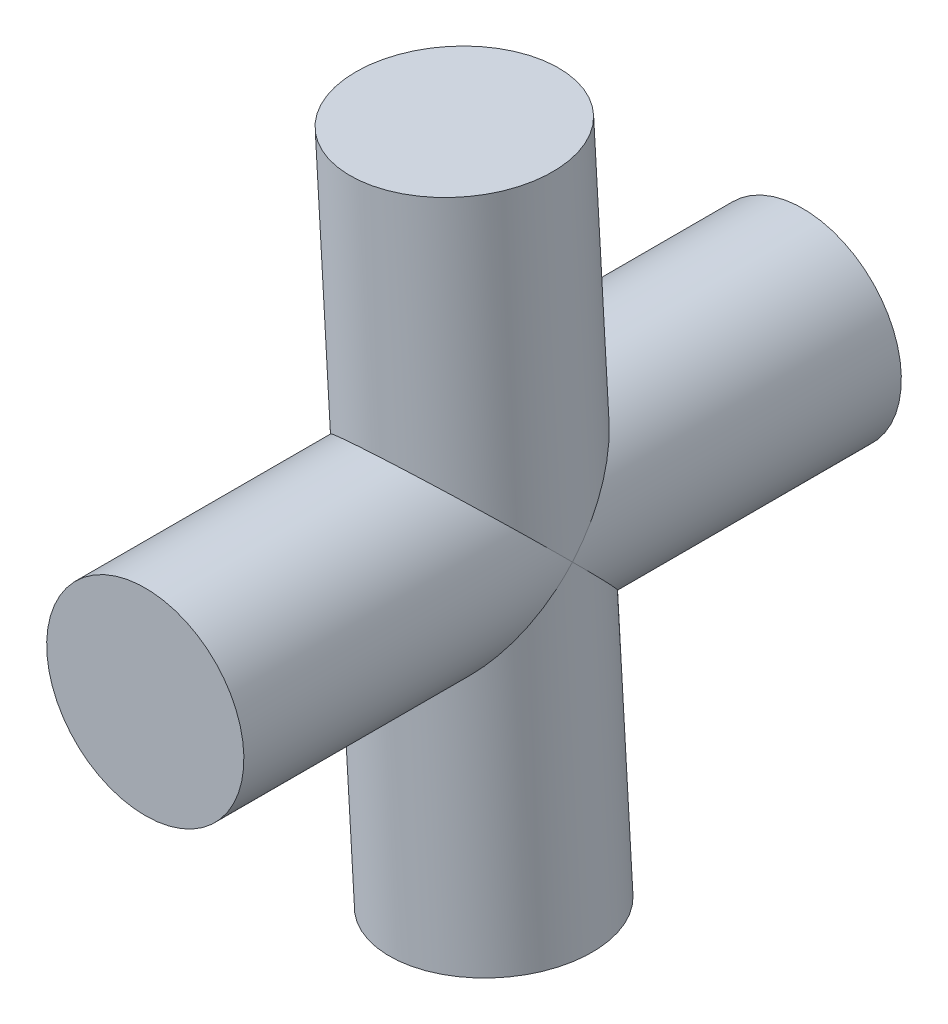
ISO-10303-21;
HEADER;
FILE_DESCRIPTION(('STEP AP214'),'2;1');
FILE_NAME('part.step','',(''),(''),'','','');
FILE_SCHEMA(('AUTOMOTIVE_DESIGN { 1 0 10303 214 1 1 1 1 }'));
ENDSEC;
DATA;
#1=APPLICATION_CONTEXT('core data for automotive mechanical design processes');
#2=APPLICATION_PROTOCOL_DEFINITION('international standard','automotive_design',2000,#1);
#3=PRODUCT_CONTEXT('',#1,'mechanical');
#4=PRODUCT('Part','Part','',(#3));
#5=PRODUCT_RELATED_PRODUCT_CATEGORY('part','',(#4));
#6=PRODUCT_DEFINITION_FORMATION('','',#4);
#7=PRODUCT_DEFINITION_CONTEXT('part definition',#1,'design');
#8=PRODUCT_DEFINITION('design','',#6,#7);
#9=PRODUCT_DEFINITION_SHAPE('','',#8);
#10=(LENGTH_UNIT() NAMED_UNIT(*) SI_UNIT(.MILLI.,.METRE.));
#11=(NAMED_UNIT(*) PLANE_ANGLE_UNIT() SI_UNIT($,.RADIAN.));
#12=(NAMED_UNIT(*) SI_UNIT($,.STERADIAN.) SOLID_ANGLE_UNIT());
#13=UNCERTAINTY_MEASURE_WITH_UNIT(LENGTH_MEASURE(1.E-05),#10,'distance_accuracy_value','');
#14=(GEOMETRIC_REPRESENTATION_CONTEXT(3) GLOBAL_UNCERTAINTY_ASSIGNED_CONTEXT((#13)) GLOBAL_UNIT_ASSIGNED_CONTEXT((#10,
#11,#12)) REPRESENTATION_CONTEXT('',''));
#15=CARTESIAN_POINT('',(0.,0.,0.));
#16=DIRECTION('',(0.,0.,1.));
#17=DIRECTION('',(1.,0.,0.));
#18=AXIS2_PLACEMENT_3D('',#15,#16,#17);
#19=CARTESIAN_POINT('',(13081.128472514,5798.72497043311,-38.7480110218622));
#20=DIRECTION('',(-9.31205876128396E-07,6.98653101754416E-06,0.999999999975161));
#21=DIRECTION('',(0.,-0.999999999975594,6.98653101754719E-06));
#22=AXIS2_PLACEMENT_3D('',#19,#20,#21);
#23=PLANE('',#22);
#24=CARTESIAN_POINT('',(13076.3745217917,5798.43973582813,-38.7480134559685));
#25=DIRECTION('',(-9.31205847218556E-07,6.98653099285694E-06,0.999999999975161));
#26=DIRECTION('',(0.,-0.999999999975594,6.98653099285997E-06));
#27=AXIS2_PLACEMENT_3D('',#24,#25,#26);
#28=CIRCLE('',#27,4.76250000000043);
#29=CARTESIAN_POINT('',(13076.3745217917,5793.67723582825,-38.7479801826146));
#30=VERTEX_POINT('',#29);
#31=EDGE_CURVE('E53',#30,#30,#28,.T.);
#32=ORIENTED_EDGE('',*,*,#31,.F.);
#33=EDGE_LOOP('',(#32));
#34=FACE_BOUND('',#33,.T.);
#35=ADVANCED_FACE('F14',(#34),#23,.F.);
#36=CARTESIAN_POINT('',(13076.3745217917,5798.43973582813,-38.7480134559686));
#37=DIRECTION('',(-9.31205847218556E-07,6.98653099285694E-06,0.999999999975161));
#38=DIRECTION('',(0.,-0.999999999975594,6.98653099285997E-06));
#39=AXIS2_PLACEMENT_3D('',#36,#37,#38);
#40=CYLINDRICAL_SURFACE('',#39,4.76250000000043);
#41=ORIENTED_EDGE('',*,*,#31,.T.);
#42=EDGE_LOOP('',(#41));
#43=FACE_BOUND('',#42,.T.);
#44=CARTESIAN_POINT('',(13081.1284577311,5798.72508134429,-22.8730110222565));
#45=CARTESIAN_POINT('',(13081.1201107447,5798.8639833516,-23.0123424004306));
#46=CARTESIAN_POINT('',(13081.1056837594,5799.00258350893,-23.1516309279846));
#47=CARTESIAN_POINT('',(13081.069215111,5799.24769650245,-23.3984772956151));
#48=CARTESIAN_POINT('',(13081.0495999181,5799.35444911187,-23.5061606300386));
#49=CARTESIAN_POINT('',(13081.017162,5799.50233553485,-23.6556021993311));
#50=CARTESIAN_POINT('',(13081.0074622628,5799.54389629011,-23.6976294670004));
#51=CARTESIAN_POINT('',(13080.9810827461,5799.65037780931,-23.805462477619));
#52=CARTESIAN_POINT('',(13080.9635687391,5799.71515225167,-23.8712090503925));
#53=CARTESIAN_POINT('',(13080.9093824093,5799.89990884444,-24.0589641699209));
#54=CARTESIAN_POINT('',(13080.8692182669,5800.01930389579,-24.1805715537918));
#55=CARTESIAN_POINT('',(13080.8031698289,5800.19242248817,-24.3573038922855));
#56=CARTESIAN_POINT('',(13080.781190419,5800.24700115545,-24.413081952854));
#57=CARTESIAN_POINT('',(13080.7362889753,5800.35277430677,-24.5213126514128));
#58=CARTESIAN_POINT('',(13080.7134780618,5800.40399526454,-24.5737853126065));
#59=CARTESIAN_POINT('',(13080.6598192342,5800.51889241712,-24.6916999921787));
#60=CARTESIAN_POINT('',(13080.6284053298,5800.58241342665,-24.7570365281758));
#61=CARTESIAN_POINT('',(13080.5633623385,5800.70674898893,-24.8851921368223));
#62=CARTESIAN_POINT('',(13080.5298203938,5800.76758941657,-24.948030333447));
#63=CARTESIAN_POINT('',(13080.460740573,5800.88657957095,-25.0711398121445));
#64=CARTESIAN_POINT('',(13080.4252880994,5800.9447563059,-25.1314328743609));
#65=CARTESIAN_POINT('',(13080.352600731,5801.05842949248,-25.2494201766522));
#66=CARTESIAN_POINT('',(13080.3154494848,5801.11395434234,-25.3071385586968));
#67=CARTESIAN_POINT('',(13080.2395727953,5801.22233499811,-25.419957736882));
#68=CARTESIAN_POINT('',(13080.2009292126,5801.27522068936,-25.4750848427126));
#69=CARTESIAN_POINT('',(13080.1222698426,5801.37833337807,-25.582715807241));
#70=CARTESIAN_POINT('',(13080.082334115,5801.42859190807,-25.635247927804));
#71=CARTESIAN_POINT('',(13080.0012858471,5801.52646034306,-25.7376950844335));
#72=CARTESIAN_POINT('',(13079.9602515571,5801.57410358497,-25.7876401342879));
#73=CARTESIAN_POINT('',(13079.877194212,5801.66675020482,-25.8849306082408));
#74=CARTESIAN_POINT('',(13079.8352476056,5801.71178893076,-25.9323075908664));
#75=CARTESIAN_POINT('',(13079.750547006,5801.79923708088,-26.0244884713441));
#76=CARTESIAN_POINT('',(13079.7078676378,5801.84168398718,-26.069325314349));
#77=CARTESIAN_POINT('',(13079.6218723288,5801.92394974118,-26.1564651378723));
#78=CARTESIAN_POINT('',(13079.578629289,5801.96380872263,-26.1988021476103));
#79=CARTESIAN_POINT('',(13079.4842725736,5802.04749944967,-26.2879775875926));
#80=CARTESIAN_POINT('',(13079.4328730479,5802.09116182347,-26.334673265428));
#81=CARTESIAN_POINT('',(13079.3286743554,5802.17585983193,-26.4255434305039));
#82=CARTESIAN_POINT('',(13079.2759345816,5802.21693278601,-26.4697512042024));
#83=CARTESIAN_POINT('',(13079.1691914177,5802.29645247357,-26.5556241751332));
#84=CARTESIAN_POINT('',(13079.1152451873,5802.33493792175,-26.597324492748));
#85=CARTESIAN_POINT('',(13079.006227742,5802.40929113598,-26.6781635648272));
#86=CARTESIAN_POINT('',(13078.9512111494,5802.4451987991,-26.7173392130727));
#87=CARTESIAN_POINT('',(13078.8401884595,5802.51440278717,-26.7931183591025));
#88=CARTESIAN_POINT('',(13078.7842342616,5802.54774018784,-26.8297603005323));
#89=CARTESIAN_POINT('',(13078.6714697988,5802.6118104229,-26.9004679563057));
#90=CARTESIAN_POINT('',(13078.6147084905,5802.64258542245,-26.9345734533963));
#91=CARTESIAN_POINT('',(13078.5004606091,5802.70153748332,-27.000210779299));
#92=CARTESIAN_POINT('',(13078.4430198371,5802.72975769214,-27.0317834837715));
#93=CARTESIAN_POINT('',(13078.3275409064,5802.78360648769,-27.0923640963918));
#94=CARTESIAN_POINT('',(13078.2695451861,5802.80927906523,-27.1214136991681));
#95=CARTESIAN_POINT('',(13078.1530815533,5802.85803989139,-27.176962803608));
#96=CARTESIAN_POINT('',(13078.0946525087,5802.88117276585,-27.2035045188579));
#97=CARTESIAN_POINT('',(13077.9774427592,5802.92485777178,-27.2540589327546));
#98=CARTESIAN_POINT('',(13077.9186972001,5802.94545501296,-27.2781140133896));
#99=CARTESIAN_POINT('',(13077.8020629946,5802.98372919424,-27.3232983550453));
#100=CARTESIAN_POINT('',(13077.7442318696,5803.00148925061,-27.3445055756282));
#101=CARTESIAN_POINT('',(13077.6280565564,5803.03472106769,-27.3846772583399));
#102=CARTESIAN_POINT('',(13077.569728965,5803.05021971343,-27.4036674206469));
#103=CARTESIAN_POINT('',(13077.4526506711,5803.07893238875,-27.439394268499));
#104=CARTESIAN_POINT('',(13077.393913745,5803.09217191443,-27.4561555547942));
#105=CARTESIAN_POINT('',(13077.2761072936,5803.1163738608,-27.4874173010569));
#106=CARTESIAN_POINT('',(13077.2170488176,5803.12736007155,-27.5019409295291));
#107=CARTESIAN_POINT('',(13077.0986890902,5803.14706221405,-27.5287239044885));
#108=CARTESIAN_POINT('',(13077.0393963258,5803.15579996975,-27.5410046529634));
#109=CARTESIAN_POINT('',(13076.9206572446,5803.17101251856,-27.5633021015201));
#110=CARTESIAN_POINT('',(13076.8612170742,5803.17750690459,-27.5733381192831));
#111=CARTESIAN_POINT('',(13076.7422715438,5803.18824018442,-27.5911499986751));
#112=CARTESIAN_POINT('',(13076.6827702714,5803.19249619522,-27.598942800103));
#113=CARTESIAN_POINT('',(13076.5637898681,5803.19876042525,-27.6122757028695));
#114=CARTESIAN_POINT('',(13076.5043131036,5803.20078306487,-27.6178301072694));
#115=CARTESIAN_POINT('',(13076.3854678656,5803.2025883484,-27.6266971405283));
#116=CARTESIAN_POINT('',(13076.3261004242,5803.20238252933,-27.6300212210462));
#117=CARTESIAN_POINT('',(13076.2075585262,5803.19973903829,-27.634441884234));
#118=CARTESIAN_POINT('',(13076.148384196,5803.19730987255,-27.6355469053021));
#119=CARTESIAN_POINT('',(13076.0301781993,5803.19021902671,-27.6355469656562));
#120=CARTESIAN_POINT('',(13075.971146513,5803.18555767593,-27.6344423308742));
#121=CARTESIAN_POINT('',(13075.8531541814,5803.17401223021,-27.6300230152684));
#122=CARTESIAN_POINT('',(13075.7941946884,5803.16711963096,-27.6266998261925));
#123=CARTESIAN_POINT('',(13075.6764292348,5803.1511199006,-27.6178349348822));
#124=CARTESIAN_POINT('',(13075.6176256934,5803.14200136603,-27.6122817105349));
#125=CARTESIAN_POINT('',(13075.5002552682,5803.12155763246,-27.5989513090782));
#126=CARTESIAN_POINT('',(13075.4416924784,5803.11021832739,-27.5911597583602));
#127=CARTESIAN_POINT('',(13075.3248871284,5803.08534081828,-27.5733503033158));
#128=CARTESIAN_POINT('',(13075.2666506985,5803.07178603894,-27.5633153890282));
#129=CARTESIAN_POINT('',(13075.1505820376,5803.04248514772,-27.541019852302));
#130=CARTESIAN_POINT('',(13075.0927582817,5803.02672025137,-27.5287398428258));
#131=CARTESIAN_POINT('',(13074.9775992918,5802.99300639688,-27.5019578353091));
#132=CARTESIAN_POINT('',(13074.9202751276,5802.97503672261,-27.4874343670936));
#133=CARTESIAN_POINT('',(13074.8061998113,5802.93692058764,-27.4561722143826));
#134=CARTESIAN_POINT('',(13074.7494625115,5802.91675176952,-27.439410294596));
#135=CARTESIAN_POINT('',(13074.636645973,5802.87424336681,-27.4036812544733));
#136=CARTESIAN_POINT('',(13074.5805835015,5802.85188006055,-27.3846894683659));
#137=CARTESIAN_POINT('',(13074.4692004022,5802.80499217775,-27.3445133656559));
#138=CARTESIAN_POINT('',(13074.4138995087,5802.78044284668,-27.323303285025));
#139=CARTESIAN_POINT('',(13074.3026786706,5802.72850068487,-27.2781192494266));
#140=CARTESIAN_POINT('',(13074.2468252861,5802.70103275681,-27.2540678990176));
#141=CARTESIAN_POINT('',(13074.135693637,5802.64365647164,-27.2035208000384));
#142=CARTESIAN_POINT('',(13074.0804557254,5802.61370745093,-27.1769826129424));
#143=CARTESIAN_POINT('',(13073.9706677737,5802.55137830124,-27.121440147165));
#144=CARTESIAN_POINT('',(13073.9161617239,5802.51895844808,-27.0923935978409));
#145=CARTESIAN_POINT('',(13073.8079558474,5802.45169315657,-27.0318184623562));
#146=CARTESIAN_POINT('',(13073.7543034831,5802.41680905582,-27.000248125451));
#147=CARTESIAN_POINT('',(13073.6479263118,5802.34462183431,-26.9346146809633));
#148=CARTESIAN_POINT('',(13073.5952522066,5802.30728129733,-26.9005106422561));
#149=CARTESIAN_POINT('',(13073.490956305,5802.23018755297,-26.8298048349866));
#150=CARTESIAN_POINT('',(13073.4393882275,5802.19039828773,-26.7931632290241));
#151=CARTESIAN_POINT('',(13073.3374322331,5802.10841345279,-26.7173834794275));
#152=CARTESIAN_POINT('',(13073.2871008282,5802.06618326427,-26.6782068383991));
#153=CARTESIAN_POINT('',(13073.1877484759,5801.97932350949,-26.5973643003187));
#154=CARTESIAN_POINT('',(13073.1387866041,5801.93466082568,-26.5556614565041));
#155=CARTESIAN_POINT('',(13073.0423074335,5801.84294117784,-26.4697817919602));
#156=CARTESIAN_POINT('',(13072.9948515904,5801.795852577,-26.4255697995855));
#157=CARTESIAN_POINT('',(13072.9015155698,5801.69929375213,-26.3346892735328));
#158=CARTESIAN_POINT('',(13072.8556988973,5801.64979355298,-26.2879874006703));
#159=CARTESIAN_POINT('',(13072.7720257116,5801.55542366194,-26.1988121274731));
#160=CARTESIAN_POINT('',(13072.7338644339,5801.51068826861,-26.1564818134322));
#161=CARTESIAN_POINT('',(13072.6583320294,5801.41874473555,-26.0693543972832));
#162=CARTESIAN_POINT('',(13072.621038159,5801.37150541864,-26.024523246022));
#163=CARTESIAN_POINT('',(13072.5474075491,5801.27456773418,-25.932352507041));
#164=CARTESIAN_POINT('',(13072.5111494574,5801.22484104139,-25.8849799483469));
#165=CARTESIAN_POINT('',(13072.4397688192,5801.12293508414,-25.7876969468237));
#166=CARTESIAN_POINT('',(13072.4047264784,5801.07072983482,-25.7377549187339));
#167=CARTESIAN_POINT('',(13072.3359621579,5800.96387614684,-25.6353122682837));
#168=CARTESIAN_POINT('',(13072.3023219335,5800.90920394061,-25.5827816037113));
#169=CARTESIAN_POINT('',(13072.2365540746,5800.79742569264,-25.4751518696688));
#170=CARTESIAN_POINT('',(13072.2045097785,5800.74029789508,-25.4200245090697));
#171=CARTESIAN_POINT('',(13072.1421325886,5800.62361864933,-25.30720300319));
#172=CARTESIAN_POINT('',(13072.1118846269,5800.56404729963,-25.2494825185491));
#173=CARTESIAN_POINT('',(13072.0533052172,5800.4424913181,-25.1314890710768));
#174=CARTESIAN_POINT('',(13072.0250603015,5800.3804884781,-25.0711919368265));
#175=CARTESIAN_POINT('',(13071.9706973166,5800.25408153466,-24.948072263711));
#176=CARTESIAN_POINT('',(13071.9446673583,5800.18966081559,-24.885227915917));
#177=CARTESIAN_POINT('',(13071.8949509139,5800.05842603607,-24.7570578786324));
#178=CARTESIAN_POINT('',(13071.8713541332,5799.99159669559,-24.6917130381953));
#179=CARTESIAN_POINT('',(13071.8318203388,5799.87111609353,-24.5738048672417));
#180=CARTESIAN_POINT('',(13071.8153018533,5799.81755133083,-24.5213472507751));
#181=CARTESIAN_POINT('',(13071.7833753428,5799.70719138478,-24.4131405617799));
#182=CARTESIAN_POINT('',(13071.768081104,5799.65038308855,-24.3573714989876));
#183=CARTESIAN_POINT('',(13071.7232021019,5799.47061326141,-24.1806357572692));
#184=CARTESIAN_POINT('',(13071.6975953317,5799.34727802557,-24.059007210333));
#185=CARTESIAN_POINT('',(13071.6658889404,5799.15731841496,-23.8712546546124));
#186=CARTESIAN_POINT('',(13071.656247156,5799.09088093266,-23.8055101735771));
#187=CARTESIAN_POINT('',(13071.6408781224,5798.96670416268,-23.6824176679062));
#188=CARTESIAN_POINT('',(13071.6348023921,5798.90897278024,-23.6251052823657));
#189=CARTESIAN_POINT('',(13071.6197241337,5798.73540092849,-23.4525039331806));
#190=CARTESIAN_POINT('',(13071.6139309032,5798.61955891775,-23.3369223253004));
#191=CARTESIAN_POINT('',(13071.6108313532,5798.38735055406,-23.1051364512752));
#192=CARTESIAN_POINT('',(13071.6135630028,5798.27098416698,-22.988931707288));
#193=CARTESIAN_POINT('',(13071.6205562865,5798.15461213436,-22.8730134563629));
#194=B_SPLINE_CURVE_WITH_KNOTS('',3,(#44,#45,#46,#47,#48,#49,#50,#51,#52,#53,#54,#55,#56,#57,
#58,#59,#60,#61,#62,#63,#64,#65,#66,#67,#68,#69,#70,#71,#72,#73,#74,#75,#76,#77,#78,#79,#80,#81,
#82,#83,#84,#85,#86,#87,#88,#89,#90,#91,#92,#93,#94,#95,#96,#97,#98,#99,#100,#101,#102,#103,
#104,#105,#106,#107,#108,#109,#110,#111,#112,#113,#114,#115,#116,#117,#118,#119,#120,#121,#122,
#123,#124,#125,#126,#127,#128,#129,#130,#131,#132,#133,#134,#135,#136,#137,#138,#139,#140,#141,
#142,#143,#144,#145,#146,#147,#148,#149,#150,#151,#152,#153,#154,#155,#156,#157,#158,#159,#160,
#161,#162,#163,#164,#165,#166,#167,#168,#169,#170,#171,#172,#173,#174,#175,#176,#177,#178,#179,
#180,#181,#182,#183,#184,#185,#186,#187,#188,#189,#190,#191,#192,#193),.UNSPECIFIED.,.F.,.F.,(4,
2,2,2,2,2,2,2,2,2,2,2,2,2,2,2,2,2,2,2,2,2,2,2,2,2,2,2,2,2,2,2,2,2,2,2,2,2,2,2,2,2,2,2,2,2,2,2,2,
2,2,2,2,2,2,2,2,2,2,2,2,2,2,2,2,2,2,2,2,2,2,2,2,2,4),(0.,0.590676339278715,1.04917152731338,
1.22885386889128,1.51064328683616,2.03556395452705,2.27876473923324,2.50911894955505,
2.79822406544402,3.07919873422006,3.35207427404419,3.61688487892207,3.87366796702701,
4.12246458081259,4.36331984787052,4.59628351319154,4.82141055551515,5.03876190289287,
5.28477951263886,5.52513799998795,5.75995541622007,5.98935836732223,6.21348263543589,
6.43247382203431,6.64648800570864,6.85569240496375,7.06026603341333,7.26040033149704,
7.45264459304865,7.64237507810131,7.82979775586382,8.01512629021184,8.19858166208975,
8.38039168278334,8.56079039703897,8.74001737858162,8.91831692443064,9.09593715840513,
9.27353119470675,9.45181025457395,9.63102254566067,9.81141242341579,9.99321949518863,
10.1766778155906,10.3620151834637,10.5494525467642,10.7392035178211,10.9314739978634,
11.1315773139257,11.3361267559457,11.5453138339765,11.7593176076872,11.9783053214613,
12.2024330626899,12.4318464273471,12.6666811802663,12.9070639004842,13.15311260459,
13.370428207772,13.5955274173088,13.8284711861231,14.0693145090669,14.3181071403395,
14.5748942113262,14.8397167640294,15.1126122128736,15.3936147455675,15.6827556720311,
15.9130423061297,16.1562093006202,16.6811637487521,16.9630207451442,17.2077217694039,
17.6987182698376,18.1919047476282),.UNSPECIFIED.);
#195=CARTESIAN_POINT('',(13081.1284577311,5798.72508134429,-22.8730110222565));
#196=VERTEX_POINT('',#195);
#197=CARTESIAN_POINT('',(13071.6205562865,5798.15461213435,-22.8730150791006));
#198=VERTEX_POINT('',#197);
#199=EDGE_CURVE('E35',#196,#198,#194,.T.);
#200=ORIENTED_EDGE('',*,*,#199,.F.);
#201=CARTESIAN_POINT('',(13071.6205562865,5798.15461213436,-22.8730134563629));
#202=CARTESIAN_POINT('',(13071.6218908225,5798.13237914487,-22.8957594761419));
#203=CARTESIAN_POINT('',(13071.6233911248,5798.11008789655,-22.9184383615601));
#204=CARTESIAN_POINT('',(13071.6267265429,5798.0653109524,-22.9637919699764));
#205=CARTESIAN_POINT('',(13071.6285632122,5798.04282483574,-22.9864661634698));
#206=CARTESIAN_POINT('',(13071.6325713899,5797.99768481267,-23.0318325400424));
#207=CARTESIAN_POINT('',(13071.6347444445,5797.97503061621,-23.0545242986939));
#208=CARTESIAN_POINT('',(13071.6394246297,5797.9294207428,-23.0997868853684));
#209=CARTESIAN_POINT('',(13071.6419332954,5797.90646414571,-23.1223566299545));
#210=CARTESIAN_POINT('',(13071.6472393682,5797.86116585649,-23.1674811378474));
#211=CARTESIAN_POINT('',(13071.65003259,5797.83882004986,-23.190032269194));
#212=CARTESIAN_POINT('',(13071.6603220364,5797.76099124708,-23.268540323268));
#213=CARTESIAN_POINT('',(13071.6686470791,5797.70553504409,-23.3244169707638));
#214=CARTESIAN_POINT('',(13071.6855375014,5797.60510963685,-23.425660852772));
#215=CARTESIAN_POINT('',(13071.6937706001,5797.56010709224,-23.47105106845));
#216=CARTESIAN_POINT('',(13071.7172712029,5797.44132244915,-23.5909318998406));
#217=CARTESIAN_POINT('',(13071.7336541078,5797.36767207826,-23.6653366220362));
#218=CARTESIAN_POINT('',(13071.7782636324,5797.18760115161,-23.8476776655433));
#219=CARTESIAN_POINT('',(13071.8084873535,5797.08151894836,-23.9554659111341));
#220=CARTESIAN_POINT('',(13071.8739475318,5796.87890643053,-24.1617089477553));
#221=CARTESIAN_POINT('',(13071.908616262,5796.78227137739,-24.2602414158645));
#222=CARTESIAN_POINT('',(13071.9813752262,5796.59848575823,-24.4479830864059));
#223=CARTESIAN_POINT('',(13072.018936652,5796.5112180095,-24.5372827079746));
#224=CARTESIAN_POINT('',(13072.1086413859,5796.31915079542,-24.7344045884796));
#225=CARTESIAN_POINT('',(13072.1621736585,5796.21472956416,-24.8419683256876));
#226=CARTESIAN_POINT('',(13072.2751474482,5796.01343208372,-25.0499721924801));
#227=CARTESIAN_POINT('',(13072.3341908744,5795.91643232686,-25.1505089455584));
#228=CARTESIAN_POINT('',(13072.4571906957,5795.72991278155,-25.344295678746));
#229=CARTESIAN_POINT('',(13072.5207626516,5795.64025974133,-25.437660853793));
#230=CARTESIAN_POINT('',(13072.651867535,5795.46839431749,-25.6170510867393));
#231=CARTESIAN_POINT('',(13072.7190299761,5795.386036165,-25.7032069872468));
#232=CARTESIAN_POINT('',(13072.8564233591,5795.22871262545,-25.8682265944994));
#233=CARTESIAN_POINT('',(13072.9262974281,5795.15358752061,-25.9472337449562));
#234=CARTESIAN_POINT('',(13073.0342923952,5795.04489527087,-26.0619745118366));
#235=CARTESIAN_POINT('',(13073.0699914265,5795.01006719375,-26.0988092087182));
#236=CARTESIAN_POINT('',(13073.1418047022,5794.94223004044,-26.1707288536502));
#237=CARTESIAN_POINT('',(13073.1778768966,5794.90919750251,-26.2058335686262));
#238=CARTESIAN_POINT('',(13073.2564794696,5794.83948115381,-26.2801189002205));
#239=CARTESIAN_POINT('',(13073.2992159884,5794.8029196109,-26.3191964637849));
#240=CARTESIAN_POINT('',(13073.38567012,5794.73161719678,-26.3956080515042));
#241=CARTESIAN_POINT('',(13073.4293531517,5794.69685484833,-26.4329611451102));
#242=CARTESIAN_POINT('',(13073.5176218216,5794.62915132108,-26.5059108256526));
#243=CARTESIAN_POINT('',(13073.5621739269,5794.59618797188,-26.541527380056));
#244=CARTESIAN_POINT('',(13073.6521002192,5794.5320771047,-26.610991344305));
#245=CARTESIAN_POINT('',(13073.6974420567,5794.50090684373,-26.6448596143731));
#246=CARTESIAN_POINT('',(13073.7888689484,5794.44037839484,-26.7108187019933));
#247=CARTESIAN_POINT('',(13073.8349229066,5794.41099687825,-26.7429311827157));
#248=CARTESIAN_POINT('',(13073.9276960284,5794.35404181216,-26.8053735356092));
#249=CARTESIAN_POINT('',(13073.9743854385,5794.32644437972,-26.8357257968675));
#250=CARTESIAN_POINT('',(13074.0683526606,5794.2730535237,-26.8946458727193));
#251=CARTESIAN_POINT('',(13074.1156021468,5794.24723569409,-26.9232367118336));
#252=CARTESIAN_POINT('',(13074.2106139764,5794.19740011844,-26.9786352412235));
#253=CARTESIAN_POINT('',(13074.2583495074,5794.17335748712,-27.0054664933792));
#254=CARTESIAN_POINT('',(13074.3542592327,5794.12706837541,-27.0573501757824));
#255=CARTESIAN_POINT('',(13074.4024082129,5794.10479658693,-27.0824265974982));
#256=CARTESIAN_POINT('',(13074.49907217,5794.06204545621,-27.1308078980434));
#257=CARTESIAN_POINT('',(13074.5475636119,5794.04154044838,-27.1541370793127));
#258=CARTESIAN_POINT('',(13074.6448411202,5794.00231848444,-27.1990338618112));
#259=CARTESIAN_POINT('',(13074.6936054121,5793.98357560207,-27.2206259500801));
#260=CARTESIAN_POINT('',(13074.7913597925,5793.94787610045,-27.2620616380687));
#261=CARTESIAN_POINT('',(13074.8403299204,5793.930893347,-27.281929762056));
#262=CARTESIAN_POINT('',(13074.9374888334,5793.89901027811,-27.3195687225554));
#263=CARTESIAN_POINT('',(13074.9856406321,5793.88405649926,-27.337389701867));
#264=CARTESIAN_POINT('',(13075.0823085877,5793.85573545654,-27.3714789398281));
#265=CARTESIAN_POINT('',(13075.130814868,5793.84235251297,-27.3877621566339));
#266=CARTESIAN_POINT('',(13075.2281400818,5793.81717149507,-27.4187690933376));
#267=CARTESIAN_POINT('',(13075.2769505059,5793.80535837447,-27.4335072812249));
#268=CARTESIAN_POINT('',(13075.3748318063,5793.78331274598,-27.4614188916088));
#269=CARTESIAN_POINT('',(13075.4238955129,5793.77306596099,-27.4746061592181));
#270=CARTESIAN_POINT('',(13075.5222315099,5793.75414930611,-27.4994125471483));
#271=CARTESIAN_POINT('',(13075.5714979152,5793.7454660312,-27.5110447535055));
#272=CARTESIAN_POINT('',(13075.6701876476,5793.72967242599,-27.5327394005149));
#273=CARTESIAN_POINT('',(13075.7196063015,5793.72254967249,-27.5428140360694));
#274=CARTESIAN_POINT('',(13075.8185492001,5793.70987309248,-27.5613936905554));
#275=CARTESIAN_POINT('',(13075.86806989,5793.70430792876,-27.5699098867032));
#276=CARTESIAN_POINT('',(13075.9671659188,5793.69474241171,-27.585374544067));
#277=CARTESIAN_POINT('',(13076.016738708,5793.69073190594,-27.5923330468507));
#278=CARTESIAN_POINT('',(13076.1158884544,5793.68427151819,-27.6046859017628));
#279=CARTESIAN_POINT('',(13076.1654637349,5793.68181275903,-27.6100890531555));
#280=CARTESIAN_POINT('',(13076.2645685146,5793.67845160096,-27.6193364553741));
#281=CARTESIAN_POINT('',(13076.3140970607,5793.67754168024,-27.6231881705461));
#282=CARTESIAN_POINT('',(13076.4130590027,5793.67727392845,-27.6293395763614));
#283=CARTESIAN_POINT('',(13076.4624920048,5793.67790999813,-27.6316453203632));
#284=CARTESIAN_POINT('',(13076.5612141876,5793.68072976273,-27.6347132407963));
#285=CARTESIAN_POINT('',(13076.6105033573,5793.68290883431,-27.6354800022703));
#286=CARTESIAN_POINT('',(13076.7089813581,5793.68881621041,-27.635479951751));
#287=CARTESIAN_POINT('',(13076.7581702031,5793.69254428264,-27.6347133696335));
#288=CARTESIAN_POINT('',(13076.8565080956,5793.70154545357,-27.6316462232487));
#289=CARTESIAN_POINT('',(13076.9056565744,5793.70682318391,-27.6293410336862));
#290=CARTESIAN_POINT('',(13077.0038660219,5793.71891918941,-27.6231910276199));
#291=CARTESIAN_POINT('',(13077.052925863,5793.72574351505,-27.6193401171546));
#292=CARTESIAN_POINT('',(13077.150909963,5793.74092842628,-27.6100944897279));
#293=CARTESIAN_POINT('',(13077.1998323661,5793.74929640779,-27.604692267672));
#294=CARTESIAN_POINT('',(13077.2974932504,5793.76756435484,-27.5923413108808));
#295=CARTESIAN_POINT('',(13077.3462289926,5793.77747297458,-27.5853837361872));
#296=CARTESIAN_POINT('',(13077.4434679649,5793.79881800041,-27.569920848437));
#297=CARTESIAN_POINT('',(13077.4919674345,5793.81026422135,-27.5614054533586));
#298=CARTESIAN_POINT('',(13077.5886850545,5793.83468033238,-27.5428271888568));
#299=CARTESIAN_POINT('',(13077.6368983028,5793.847661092,-27.5327531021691));
#300=CARTESIAN_POINT('',(13077.7329944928,5793.87514224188,-27.5110592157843));
#301=CARTESIAN_POINT('',(13077.7808712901,5793.88965444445,-27.4994271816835));
#302=CARTESIAN_POINT('',(13077.8762454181,5793.92019458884,-27.4746206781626));
#303=CARTESIAN_POINT('',(13077.923735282,5793.93623517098,-27.4614330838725));
#304=CARTESIAN_POINT('',(13078.018286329,5793.9698281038,-27.4335202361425));
#305=CARTESIAN_POINT('',(13078.065338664,5793.98739380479,-27.4187810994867));
#306=CARTESIAN_POINT('',(13078.158965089,5794.02403380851,-27.3877715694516));
#307=CARTESIAN_POINT('',(13078.2055289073,5794.04312206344,-27.371486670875));
#308=CARTESIAN_POINT('',(13078.2981296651,5794.08280147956,-27.3373932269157));
#309=CARTESIAN_POINT('',(13078.3441548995,5794.10340705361,-27.3195696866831));
#310=CARTESIAN_POINT('',(13078.4368043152,5794.14667577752,-27.2819307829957));
#311=CARTESIAN_POINT('',(13078.4833857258,5794.1693872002,-27.2620656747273));
#312=CARTESIAN_POINT('',(13078.5761580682,5794.21651036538,-27.2206359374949));
#313=CARTESIAN_POINT('',(13078.62232602,5794.24094571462,-27.1990467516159));
#314=CARTESIAN_POINT('',(13078.7142065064,5794.29151090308,-27.1541555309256));
#315=CARTESIAN_POINT('',(13078.7598942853,5794.31766391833,-27.1308289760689));
#316=CARTESIAN_POINT('',(13078.8507464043,5794.3716612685,-27.0824525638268));
#317=CARTESIAN_POINT('',(13078.8958842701,5794.3995283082,-27.0573783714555));
#318=CARTESIAN_POINT('',(13078.9855671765,5794.45694979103,-27.0054986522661));
#319=CARTESIAN_POINT('',(13079.030084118,5794.48652637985,-26.9786691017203));
#320=CARTESIAN_POINT('',(13079.1184540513,5794.54736321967,-26.9232733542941));
#321=CARTESIAN_POINT('',(13079.1622774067,5794.57864500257,-26.8946835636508));
#322=CARTESIAN_POINT('',(13079.2491875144,5794.64288840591,-26.8357648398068));
#323=CARTESIAN_POINT('',(13079.2922431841,5794.67587089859,-26.8054128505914));
#324=CARTESIAN_POINT('',(13079.3775438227,5794.74351184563,-26.7429701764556));
#325=CARTESIAN_POINT('',(13079.4197563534,5794.7781904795,-26.7108570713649));
#326=CARTESIAN_POINT('',(13079.5032952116,5794.84921987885,-26.6448957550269));
#327=CARTESIAN_POINT('',(13079.5445878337,5794.88559011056,-26.6110258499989));
#328=CARTESIAN_POINT('',(13079.6262103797,5794.95999845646,-26.5415575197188));
#329=CARTESIAN_POINT('',(13079.6665054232,5794.99805530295,-26.5059382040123));
#330=CARTESIAN_POINT('',(13079.7460543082,5795.0758340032,-26.432981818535));
#331=CARTESIAN_POINT('',(13079.7852721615,5795.1155738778,-26.395624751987));
#332=CARTESIAN_POINT('',(13079.8625906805,5795.196710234,-26.3192038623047));
#333=CARTESIAN_POINT('',(13079.9006544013,5795.23812391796,-26.2801209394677));
#334=CARTESIAN_POINT('',(13079.9703571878,5795.31673633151,-26.2058355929));
#335=CARTESIAN_POINT('',(13080.002216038,5795.35383809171,-26.170736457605));
#336=CARTESIAN_POINT('',(13080.0653943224,5795.42976271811,-26.0988273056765));
#337=CARTESIAN_POINT('',(13080.096669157,5795.46860387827,-26.0619975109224));
#338=CARTESIAN_POINT('',(13080.1908851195,5795.58941608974,-25.947268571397));
#339=CARTESIAN_POINT('',(13080.2512711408,5795.67234967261,-25.8682686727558));
#340=CARTESIAN_POINT('',(13080.3688637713,5795.84496272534,-25.7032596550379));
#341=CARTESIAN_POINT('',(13080.4256966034,5795.93475823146,-25.6171069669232));
#342=CARTESIAN_POINT('',(13080.5353139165,5796.12106685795,-25.4377185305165));
#343=CARTESIAN_POINT('',(13080.5877127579,5796.21768050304,-25.3443518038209));
#344=CARTESIAN_POINT('',(13080.6875358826,5796.41757886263,-25.1505568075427));
#345=CARTESIAN_POINT('',(13080.7345621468,5796.52094998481,-25.0500132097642));
#346=CARTESIAN_POINT('',(13080.8226669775,5796.73433093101,-24.8419897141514));
#347=CARTESIAN_POINT('',(13080.8633351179,5796.84441581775,-24.7344130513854));
#348=CARTESIAN_POINT('',(13080.9294283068,5797.0458212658,-24.5372990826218));
#349=CARTESIAN_POINT('',(13080.9562800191,5797.1369319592,-24.448020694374));
#350=CARTESIAN_POINT('',(13081.0065387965,5797.32807678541,-24.2603013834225));
#351=CARTESIAN_POINT('',(13081.0294054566,5797.42816423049,-24.1617699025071));
#352=CARTESIAN_POINT('',(13081.0701771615,5797.63717200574,-23.9555045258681));
#353=CARTESIAN_POINT('',(13081.0875045,5797.74612845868,-23.8476925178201));
#354=CARTESIAN_POINT('',(13081.1102628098,5797.93024564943,-23.6653517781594));
#355=CARTESIAN_POINT('',(13081.1177198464,5798.00530863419,-23.5909690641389));
#356=CARTESIAN_POINT('',(13081.1307144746,5798.17712373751,-23.4203656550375));
#357=CARTESIAN_POINT('',(13081.1350737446,5798.27387195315,-23.3240489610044));
#358=CARTESIAN_POINT('',(13081.1382179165,5798.4888850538,-23.1095297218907));
#359=CARTESIAN_POINT('',(13081.1355334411,5798.60710946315,-22.9912631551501));
#360=CARTESIAN_POINT('',(13081.1284577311,5798.72508134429,-22.8730110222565));
#361=B_SPLINE_CURVE_WITH_KNOTS('',3,(#201,#202,#203,#204,#205,#206,#207,#208,#209,#210,#211,
#212,#213,#214,#215,#216,#217,#218,#219,#220,#221,#222,#223,#224,#225,#226,#227,#228,#229,#230,
#231,#232,#233,#234,#235,#236,#237,#238,#239,#240,#241,#242,#243,#244,#245,#246,#247,#248,#249,
#250,#251,#252,#253,#254,#255,#256,#257,#258,#259,#260,#261,#262,#263,#264,#265,#266,#267,#268,
#269,#270,#271,#272,#273,#274,#275,#276,#277,#278,#279,#280,#281,#282,#283,#284,#285,#286,#287,
#288,#289,#290,#291,#292,#293,#294,#295,#296,#297,#298,#299,#300,#301,#302,#303,#304,#305,#306,
#307,#308,#309,#310,#311,#312,#313,#314,#315,#316,#317,#318,#319,#320,#321,#322,#323,#324,#325,
#326,#327,#328,#329,#330,#331,#332,#333,#334,#335,#336,#337,#338,#339,#340,#341,#342,#343,#344,
#345,#346,#347,#348,#349,#350,#351,#352,#353,#354,#355,#356,#357,#358,#359,#360),.UNSPECIFIED.,
.F.,.F.,(4,2,2,2,2,2,2,2,2,2,2,2,2,2,2,2,2,2,2,2,2,2,2,2,2,2,2,2,2,2,2,2,2,2,2,2,2,2,2,2,2,2,2,
2,2,2,2,2,2,2,2,2,2,2,2,2,2,2,2,2,2,2,2,2,2,2,2,2,2,2,2,2,2,2,2,2,2,2,2,4),(0.,
0.0955039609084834,0.191460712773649,0.287872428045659,0.384741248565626,0.480348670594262,
0.717812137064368,0.911138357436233,1.22897716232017,1.69144485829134,2.11818065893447,
2.50921949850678,2.98650102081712,3.44125863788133,3.87365073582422,4.28386165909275,
4.67210740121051,4.8580905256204,5.03868119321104,5.24409630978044,5.44556826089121,
5.64316417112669,5.83695519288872,6.02701675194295,6.21342880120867,6.39627608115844,
6.57564838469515,6.75164082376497,6.92435409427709,7.09389473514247,7.26037537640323,
7.42076370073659,7.57938297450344,7.73635125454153,7.89179035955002,8.04582573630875,
8.19858628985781,8.35020417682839,8.50081456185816,8.65055533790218,8.79956681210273,
8.94799135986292,9.09597305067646,9.24393255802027,9.39233887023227,9.54133610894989,
9.69106668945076,9.84167094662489,9.99328678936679,10.1460493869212,10.3000908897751,
10.4555401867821,10.6125226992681,10.7711602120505,10.9315707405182,11.0980251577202,
11.2675442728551,11.4402407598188,11.6162211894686,11.7955862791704,11.9784311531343,
12.1648456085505,12.3549143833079,12.5487174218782,12.7463301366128,12.9478236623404,
13.1532651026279,13.3338254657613,13.5197837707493,13.9079963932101,14.3181962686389,
14.7505994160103,15.205390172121,15.6827268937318,16.0736720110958,16.5004078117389,
16.962969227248,17.2807293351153,17.6903620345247,18.1918606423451),.UNSPECIFIED.);
#362=EDGE_CURVE('E33',#198,#196,#361,.T.);
#363=ORIENTED_EDGE('',*,*,#362,.F.);
#364=EDGE_LOOP('',(#200,#363));
#365=FACE_BOUND('',#364,.T.);
#366=ADVANCED_FACE('F37',(#43,#365),#40,.T.);
#367=CARTESIAN_POINT('',(13082.0792397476,5782.87857893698,-22.8728994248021));
#368=DIRECTION('',(-0.0598917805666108,0.998204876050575,-7.02976090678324E-06));
#369=DIRECTION('',(-0.998204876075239,-0.0598917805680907,0.));
#370=AXIS2_PLACEMENT_3D('',#367,#368,#369);
#371=PLANE('',#370);
#372=CARTESIAN_POINT('',(13077.3252890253,5782.59334433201,-22.8729018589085));
#373=DIRECTION('',(-0.059891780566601,0.998204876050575,-7.02976090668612E-06));
#374=DIRECTION('',(-0.99820487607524,-0.0598917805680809,0.));
#375=AXIS2_PLACEMENT_3D('',#372,#373,#374);
#376=CIRCLE('',#375,4.76250000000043);
#377=CARTESIAN_POINT('',(13072.5713383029,5782.30810972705,-22.8729018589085));
#378=VERTEX_POINT('',#377);
#379=EDGE_CURVE('E42',#378,#378,#376,.T.);
#380=ORIENTED_EDGE('',*,*,#379,.F.);
#381=EDGE_LOOP('',(#380));
#382=FACE_BOUND('',#381,.T.);
#383=ADVANCED_FACE('F140',(#382),#371,.F.);
#384=CARTESIAN_POINT('',(13080.1776757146,5814.57158375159,-22.8731226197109));
#385=DIRECTION('',(-0.0598917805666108,0.998204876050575,-7.02976090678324E-06));
#386=DIRECTION('',(-0.998204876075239,-0.0598917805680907,0.));
#387=AXIS2_PLACEMENT_3D('',#384,#385,#386);
#388=PLANE('',#387);
#389=CARTESIAN_POINT('',(13075.4237249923,5814.28634914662,-22.8731250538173));
#390=DIRECTION('',(-0.0598917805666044,0.998204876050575,-7.02976090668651E-06));
#391=DIRECTION('',(-0.99820487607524,-0.0598917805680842,0.));
#392=AXIS2_PLACEMENT_3D('',#389,#390,#391);
#393=CIRCLE('',#392,4.76250000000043);
#394=CARTESIAN_POINT('',(13070.66977427,5814.00111454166,-22.8731250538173));
#395=VERTEX_POINT('',#394);
#396=EDGE_CURVE('E60',#395,#395,#393,.F.);
#397=ORIENTED_EDGE('',*,*,#396,.F.);
#398=EDGE_LOOP('',(#397));
#399=FACE_BOUND('',#398,.T.);
#400=ADVANCED_FACE('F132',(#399),#388,.T.);
#401=CARTESIAN_POINT('',(13077.3252890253,5782.59334433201,-22.8729018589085));
#402=DIRECTION('',(-0.059891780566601,0.998204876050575,-7.02976090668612E-06));
#403=DIRECTION('',(-0.99820487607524,-0.0598917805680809,0.));
#404=AXIS2_PLACEMENT_3D('',#401,#402,#403);
#405=CYLINDRICAL_SURFACE('',#404,4.76250000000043);
#406=ORIENTED_EDGE('',*,*,#362,.T.);
#407=CARTESIAN_POINT('',(13071.6205562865,5798.15461213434,-22.8730158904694));
#408=CARTESIAN_POINT('',(13071.6282242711,5798.02691424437,-22.7452019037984));
#409=CARTESIAN_POINT('',(13071.641024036,5797.89952955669,-22.6173645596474));
#410=CARTESIAN_POINT('',(13071.6732959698,5797.67141092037,-22.3877616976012));
#411=CARTESIAN_POINT('',(13071.6909052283,5797.57047628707,-22.2859304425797));
#412=CARTESIAN_POINT('',(13071.7240135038,5797.41129893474,-22.1249268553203));
#413=CARTESIAN_POINT('',(13071.7373493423,5797.35274283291,-22.0656096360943));
#414=CARTESIAN_POINT('',(13071.787360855,5797.15093065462,-21.8610581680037));
#415=CARTESIAN_POINT('',(13071.8297586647,5797.00842866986,-21.7164188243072));
#416=CARTESIAN_POINT('',(13071.9147493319,5796.76544282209,-21.4688216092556));
#417=CARTESIAN_POINT('',(13071.954038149,5796.6642490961,-21.3654109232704));
#418=CARTESIAN_POINT('',(13072.0169878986,5796.51735599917,-21.2149480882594));
#419=CARTESIAN_POINT('',(13072.0377540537,5796.47095181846,-21.1673639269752));
#420=CARTESIAN_POINT('',(13072.0865146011,5796.36653608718,-21.0602209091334));
#421=CARTESIAN_POINT('',(13072.114985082,5796.3086416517,-21.0007633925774));
#422=CARTESIAN_POINT('',(13072.1737693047,5796.19504229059,-20.8839703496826));
#423=CARTESIAN_POINT('',(13072.2040173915,5796.13931921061,-20.8266194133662));
#424=CARTESIAN_POINT('',(13072.2661895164,5796.03009097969,-20.7140366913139));
#425=CARTESIAN_POINT('',(13072.2980491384,5795.97656591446,-20.6587886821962));
#426=CARTESIAN_POINT('',(13072.3632816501,5795.87175030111,-20.5504137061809));
#427=CARTESIAN_POINT('',(13072.3965913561,5795.82043826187,-20.4972695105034));
#428=CARTESIAN_POINT('',(13072.4645653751,5795.7200563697,-20.3931029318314));
#429=CARTESIAN_POINT('',(13072.4991677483,5795.67096357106,-20.3420622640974));
#430=CARTESIAN_POINT('',(13072.5695730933,5795.57501893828,-20.2421038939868));
#431=CARTESIAN_POINT('',(13072.6053153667,5795.52814283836,-20.19316675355));
#432=CARTESIAN_POINT('',(13072.6778514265,5795.43662223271,-20.0974166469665));
#433=CARTESIAN_POINT('',(13072.7145857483,5795.39195226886,-20.0505829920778));
#434=CARTESIAN_POINT('',(13072.788961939,5795.30482706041,-19.9590410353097));
#435=CARTESIAN_POINT('',(13072.8265455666,5795.26234528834,-19.9143106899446));
#436=CARTESIAN_POINT('',(13072.9024820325,5795.17957241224,-19.8269771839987));
#437=CARTESIAN_POINT('',(13072.9407778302,5795.13925383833,-19.7843504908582));
#438=CARTESIAN_POINT('',(13073.0180050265,5795.06077770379,-19.7012242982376));
#439=CARTESIAN_POINT('',(13073.0568805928,5795.0225918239,-19.6606997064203));
#440=CARTESIAN_POINT('',(13073.1351423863,5794.94834285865,-19.5817847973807));
#441=CARTESIAN_POINT('',(13073.1744738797,5794.91225080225,-19.5433674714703));
#442=CARTESIAN_POINT('',(13073.2602347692,5794.83619925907,-19.4623002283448));
#443=CARTESIAN_POINT('',(13073.306905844,5794.7963749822,-19.4197785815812));
#444=CARTESIAN_POINT('',(13073.4014116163,5794.71887886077,-19.3368303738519));
#445=CARTESIAN_POINT('',(13073.4492015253,5794.68117941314,-19.2963785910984));
#446=CARTESIAN_POINT('',(13073.5458423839,5794.60794326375,-19.217576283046));
#447=CARTESIAN_POINT('',(13073.5946500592,5794.57237778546,-19.1791994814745));
#448=CARTESIAN_POINT('',(13073.6932211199,5794.50341873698,-19.1045467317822));
#449=CARTESIAN_POINT('',(13073.7429429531,5794.46999525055,-19.0682435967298));
#450=CARTESIAN_POINT('',(13073.8432397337,5794.40532354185,-18.9977394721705));
#451=CARTESIAN_POINT('',(13073.8937749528,5794.37404440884,-18.963510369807));
#452=CARTESIAN_POINT('',(13073.9955974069,5794.31366040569,-18.8971551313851));
#453=CARTESIAN_POINT('',(13074.0468468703,5794.28452376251,-18.8649999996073));
#454=CARTESIAN_POINT('',(13074.1499988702,5794.22841917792,-18.8027936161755));
#455=CARTESIAN_POINT('',(13074.2018657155,5794.20141875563,-18.7727125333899));
#456=CARTESIAN_POINT('',(13074.3061552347,5794.14957697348,-18.7146550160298));
#457=CARTESIAN_POINT('',(13074.3585444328,5794.12470258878,-18.6866479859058));
#458=CARTESIAN_POINT('',(13074.4667930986,5794.07573794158,-18.6311986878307));
#459=CARTESIAN_POINT('',(13074.5227095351,5794.05170867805,-18.6038135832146));
#460=CARTESIAN_POINT('',(13074.6349517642,5794.00603428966,-18.5514025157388));
#461=CARTESIAN_POINT('',(13074.6912437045,5793.98434939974,-18.5263388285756));
#462=CARTESIAN_POINT('',(13074.7969032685,5793.94596356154,-18.4816393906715));
#463=CARTESIAN_POINT('',(13074.8460673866,5793.92899928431,-18.4617483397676));
#464=CARTESIAN_POINT('',(13074.9448378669,5793.89673672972,-18.423625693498));
#465=CARTESIAN_POINT('',(13074.9944319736,5793.88142100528,-18.4053771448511));
#466=CARTESIAN_POINT('',(13075.0970564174,5793.85157432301,-18.3694690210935));
#467=CARTESIAN_POINT('',(13075.1501351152,5793.83712007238,-18.3518836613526));
#468=CARTESIAN_POINT('',(13075.2566573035,5793.81010395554,-18.3185830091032));
#469=CARTESIAN_POINT('',(13075.3100899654,5793.79752262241,-18.3028488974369));
#470=CARTESIAN_POINT('',(13075.4172516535,5793.77425444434,-18.2732495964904));
#471=CARTESIAN_POINT('',(13075.4709717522,5793.76354918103,-18.2593665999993));
#472=CARTESIAN_POINT('',(13075.5786400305,5793.74403275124,-18.2334685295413));
#473=CARTESIAN_POINT('',(13075.6325810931,5793.73520441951,-18.2214368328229));
#474=CARTESIAN_POINT('',(13075.7406238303,5793.71943890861,-18.1992400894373));
#475=CARTESIAN_POINT('',(13075.7947200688,5793.71248601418,-18.1890597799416));
#476=CARTESIAN_POINT('',(13075.9030055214,5793.70046596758,-18.1705644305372));
#477=CARTESIAN_POINT('',(13075.9571908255,5793.69538473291,-18.1622356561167));
#478=CARTESIAN_POINT('',(13076.0718771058,5793.68661965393,-18.1465836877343));
#479=CARTESIAN_POINT('',(13076.1324230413,5793.68314834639,-18.1394688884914));
#480=CARTESIAN_POINT('',(13076.2534590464,5793.67853556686,-18.1275629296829));
#481=CARTESIAN_POINT('',(13076.3139472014,5793.67738000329,-18.1227578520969));
#482=CARTESIAN_POINT('',(13076.4220750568,5793.67737991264,-18.1162354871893));
#483=CARTESIAN_POINT('',(13076.4696890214,5793.67809302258,-18.1140770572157));
#484=CARTESIAN_POINT('',(13076.5647950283,5793.68094605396,-18.1112013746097));
#485=CARTESIAN_POINT('',(13076.6122870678,5793.68308228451,-18.1104804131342));
#486=CARTESIAN_POINT('',(13076.7134544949,5793.68915232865,-18.1104794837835));
#487=CARTESIAN_POINT('',(13076.7671180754,5793.69328630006,-18.1114024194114));
#488=CARTESIAN_POINT('',(13076.8743929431,5793.70338039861,-18.115086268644));
#489=CARTESIAN_POINT('',(13076.928003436,5793.70934667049,-18.1178534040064));
#490=CARTESIAN_POINT('',(13077.035110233,5793.72310852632,-18.1252231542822));
#491=CARTESIAN_POINT('',(13077.088604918,5793.73091227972,-18.1298340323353));
#492=CARTESIAN_POINT('',(13077.195417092,5793.74835015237,-18.1408893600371));
#493=CARTESIAN_POINT('',(13077.2487318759,5793.75799435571,-18.147344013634));
#494=CARTESIAN_POINT('',(13077.3551212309,5793.77911208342,-18.1620849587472));
#495=CARTESIAN_POINT('',(13077.4081917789,5793.79059746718,-18.170383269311));
#496=CARTESIAN_POINT('',(13077.514029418,5793.81539441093,-18.1888097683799));
#497=CARTESIAN_POINT('',(13077.5667909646,5793.82871944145,-18.1989516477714));
#498=CARTESIAN_POINT('',(13077.6719471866,5793.85719039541,-18.2210636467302));
#499=CARTESIAN_POINT('',(13077.7243346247,5793.87235121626,-18.2330489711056));
#500=CARTESIAN_POINT('',(13077.8286793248,5793.90448643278,-18.2588464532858));
#501=CARTESIAN_POINT('',(13077.8806275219,5793.92147695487,-18.2726751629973));
#502=CARTESIAN_POINT('',(13077.9840296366,5793.95726177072,-18.3021579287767));
#503=CARTESIAN_POINT('',(13078.0354725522,5793.97607320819,-18.3178297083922));
#504=CARTESIAN_POINT('',(13078.1378028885,5794.01548920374,-18.3509982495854));
#505=CARTESIAN_POINT('',(13078.1886773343,5794.03611172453,-18.368513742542));
#506=CARTESIAN_POINT('',(13078.2642883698,5794.06827917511,-18.3960690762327));
#507=CARTESIAN_POINT('',(13078.2894862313,5794.07925911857,-18.4055129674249));
#508=CARTESIAN_POINT('',(13078.3397177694,5794.10166418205,-18.4248585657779));
#509=CARTESIAN_POINT('',(13078.3647494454,5794.11309164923,-18.4347627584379));
#510=CARTESIAN_POINT('',(13078.4152446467,5794.13667187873,-18.4552771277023));
#511=CARTESIAN_POINT('',(13078.4406977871,5794.14883613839,-18.4658996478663));
#512=CARTESIAN_POINT('',(13078.4914940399,5794.17366570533,-18.4876598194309));
#513=CARTESIAN_POINT('',(13078.5168335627,5794.18633478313,-18.4988015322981));
#514=CARTESIAN_POINT('',(13078.5930542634,5794.22529225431,-18.5331712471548));
#515=CARTESIAN_POINT('',(13078.6433568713,5794.25216615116,-18.5570263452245));
#516=CARTESIAN_POINT('',(13078.7434061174,5794.30792162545,-18.6067791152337));
#517=CARTESIAN_POINT('',(13078.7931201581,5794.3368330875,-18.6327086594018));
#518=CARTESIAN_POINT('',(13078.8919058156,5794.39667258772,-18.6866117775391));
#519=CARTESIAN_POINT('',(13078.9409424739,5794.42763008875,-18.7146166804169));
#520=CARTESIAN_POINT('',(13079.0382814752,5794.49156519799,-18.7726708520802));
#521=CARTESIAN_POINT('',(13079.0865465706,5794.52457162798,-18.8027507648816));
#522=CARTESIAN_POINT('',(13079.182249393,5794.59260457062,-18.8649557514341));
#523=CARTESIAN_POINT('',(13079.2296477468,5794.62765910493,-18.897110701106));
#524=CARTESIAN_POINT('',(13079.3235219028,5794.69978394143,-18.9634665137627));
#525=CARTESIAN_POINT('',(13079.3699563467,5794.73688131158,-18.9976964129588));
#526=CARTESIAN_POINT('',(13079.4618057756,5794.8130830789,-19.0682030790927));
#527=CARTESIAN_POINT('',(13079.5071775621,5794.8522134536,-19.1045079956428));
#528=CARTESIAN_POINT('',(13079.5968034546,5794.93246819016,-19.1791652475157));
#529=CARTESIAN_POINT('',(13079.6410126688,5794.97361732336,-19.2175448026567));
#530=CARTESIAN_POINT('',(13079.7282129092,5795.05789067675,-19.2963536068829));
#531=CARTESIAN_POINT('',(13079.7711574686,5795.10103832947,-19.3368091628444));
#532=CARTESIAN_POINT('',(13079.8557304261,5795.189289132,-19.4197657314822));
#533=CARTESIAN_POINT('',(13079.897310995,5795.23441436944,-19.4622919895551));
#534=CARTESIAN_POINT('',(13079.9733634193,5795.32017470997,-19.5433569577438));
#535=CARTESIAN_POINT('',(13080.0080919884,5795.36070422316,-19.5817670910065));
#536=CARTESIAN_POINT('',(13080.0769053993,5795.44376621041,-19.6606691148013));
#537=CARTESIAN_POINT('',(13080.1109323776,5795.48632091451,-19.7011880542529));
#538=CARTESIAN_POINT('',(13080.1782159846,5795.57345804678,-19.7843042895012));
#539=CARTESIAN_POINT('',(13080.2114137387,5795.61806193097,-19.826926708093));
#540=CARTESIAN_POINT('',(13080.2769047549,5795.70931295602,-19.9142530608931));
#541=CARTESIAN_POINT('',(13080.3091380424,5795.75598056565,-19.9589805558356));
#542=CARTESIAN_POINT('',(13080.3725619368,5795.85136865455,-20.0505181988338));
#543=CARTESIAN_POINT('',(13080.4036914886,5795.90010852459,-20.0973504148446));
#544=CARTESIAN_POINT('',(13080.4647649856,5795.99964319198,-20.1930990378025));
#545=CARTESIAN_POINT('',(13080.4946467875,5796.05045617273,-20.2420361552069));
#546=CARTESIAN_POINT('',(13080.5530776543,5796.15413130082,-20.3419958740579));
#547=CARTESIAN_POINT('',(13080.5815634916,5796.20701030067,-20.3930379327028));
#548=CARTESIAN_POINT('',(13080.6370513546,5796.31480326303,-20.4972086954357));
#549=CARTESIAN_POINT('',(13080.6639890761,5796.36973261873,-20.550355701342));
#550=CARTESIAN_POINT('',(13080.7162260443,5796.48160300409,-20.6587376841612));
#551=CARTESIAN_POINT('',(13080.7414599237,5796.53855783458,-20.7139899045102));
#552=CARTESIAN_POINT('',(13080.7901315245,5796.65444661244,-20.8265825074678));
#553=CARTESIAN_POINT('',(13080.8135028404,5796.71339264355,-20.8839391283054));
#554=CARTESIAN_POINT('',(13080.8582885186,5796.83321994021,-21.0007447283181));
#555=CARTESIAN_POINT('',(13080.8796354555,5796.89411140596,-21.0602091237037));
#556=CARTESIAN_POINT('',(13080.9155592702,5797.00360122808,-21.1673449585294));
#557=CARTESIAN_POINT('',(13080.930623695,5797.0521403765,-21.2149147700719));
#558=CARTESIAN_POINT('',(13080.9755530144,5797.20548494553,-21.3653519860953));
#559=CARTESIAN_POINT('',(13081.0024604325,5797.31064917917,-21.4687496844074));
#560=CARTESIAN_POINT('',(13081.0510955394,5797.53161704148,-21.6864031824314));
#561=CARTESIAN_POINT('',(13081.0720903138,5797.64748411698,-21.8007590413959));
#562=CARTESIAN_POINT('',(13081.0931240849,5797.79409412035,-21.945800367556));
#563=CARTESIAN_POINT('',(13081.0972094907,5797.8246871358,-21.9760849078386));
#564=CARTESIAN_POINT('',(13081.108378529,5797.91498953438,-22.0655786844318));
#565=CARTESIAN_POINT('',(13081.1146160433,5797.97470446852,-22.1248903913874));
#566=CARTESIAN_POINT('',(13081.1284542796,5798.13667969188,-22.2858899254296));
#567=CARTESIAN_POINT('',(13081.1338695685,5798.23899422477,-22.3877155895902));
#568=CARTESIAN_POINT('',(13081.1386370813,5798.46935092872,-22.6173226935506));
#569=CARTESIAN_POINT('',(13081.1361143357,5798.5973697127,-22.7451694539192));
#570=CARTESIAN_POINT('',(13081.1284577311,5798.72508134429,-22.8730110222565));
#571=B_SPLINE_CURVE_WITH_KNOTS('',3,(#407,#408,#409,#410,#411,#412,#413,#414,#415,#416,#417,
#418,#419,#420,#421,#422,#423,#424,#425,#426,#427,#428,#429,#430,#431,#432,#433,#434,#435,#436,
#437,#438,#439,#440,#441,#442,#443,#444,#445,#446,#447,#448,#449,#450,#451,#452,#453,#454,#455,
#456,#457,#458,#459,#460,#461,#462,#463,#464,#465,#466,#467,#468,#469,#470,#471,#472,#473,#474,
#475,#476,#477,#478,#479,#480,#481,#482,#483,#484,#485,#486,#487,#488,#489,#490,#491,#492,#493,
#494,#495,#496,#497,#498,#499,#500,#501,#502,#503,#504,#505,#506,#507,#508,#509,#510,#511,#512,
#513,#514,#515,#516,#517,#518,#519,#520,#521,#522,#523,#524,#525,#526,#527,#528,#529,#530,#531,
#532,#533,#534,#535,#536,#537,#538,#539,#540,#541,#542,#543,#544,#545,#546,#547,#548,#549,#550,
#551,#552,#553,#554,#555,#556,#557,#558,#559,#560,#561,#562,#563,#564,#565,#566,#567,#568,#569,
#570),.UNSPECIFIED.,.F.,.F.,(4,2,2,2,2,2,2,2,2,2,2,2,2,2,2,2,2,2,2,2,2,2,2,2,2,2,2,2,2,2,2,2,2,
2,2,2,2,2,2,2,2,2,2,2,2,2,2,2,2,2,2,2,2,2,2,2,2,2,2,2,2,2,2,2,2,2,2,2,2,2,2,2,2,2,2,2,2,2,2,2,2,
4),(0.,0.542455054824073,0.975664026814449,1.22887753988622,1.85059890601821,2.30018562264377,
2.50906899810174,2.77223048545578,3.02867024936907,3.2784115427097,3.52147954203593,
3.75790155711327,3.98770726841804,4.21092899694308,4.42760201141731,4.63776487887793,
4.84145986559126,5.03873339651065,5.26262324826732,5.48182787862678,5.69643513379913,
5.9065386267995,6.11223811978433,6.31363991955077,6.51085728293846,6.70401082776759,
6.90415782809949,7.10005862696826,7.26706120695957,7.43207328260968,7.6052773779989,
7.77653215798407,7.94599786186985,8.11383985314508,8.28022833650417,8.44533801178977,
8.62843482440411,8.81041404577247,8.95337742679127,9.09597146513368,9.25739930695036,
9.41937453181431,9.58208396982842,9.74571193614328,9.91043966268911,10.0764447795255,
10.243900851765,10.4129769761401,10.5838374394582,10.7566414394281,10.8438258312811,
10.9315533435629,11.0219781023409,11.1132988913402,11.2986930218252,11.4878920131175,
11.681032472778,11.8782428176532,12.0796436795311,12.2853483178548,12.4954630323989,
12.7100875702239,12.9293155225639,13.1532347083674,13.3504753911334,13.5541440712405,
13.7642871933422,13.980947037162,14.204162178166,14.4339678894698,14.6703964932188,
14.9134776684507,15.1632387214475,15.419704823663,15.6828992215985,15.8917197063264,
16.3412645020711,16.833428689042,16.9631495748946,17.2163053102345,17.649504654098,
18.1920270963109),.UNSPECIFIED.);
#572=EDGE_CURVE('E50',#198,#196,#571,.T.);
#573=ORIENTED_EDGE('',*,*,#572,.F.);
#574=EDGE_LOOP('',(#406,#573));
#575=FACE_BOUND('',#574,.T.);
#576=ORIENTED_EDGE('',*,*,#379,.T.);
#577=EDGE_LOOP('',(#576));
#578=FACE_BOUND('',#577,.T.);
#579=ADVANCED_FACE('F48',(#575,#578),#405,.T.);
#580=CARTESIAN_POINT('',(13076.3802117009,5798.34476772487,-22.8730127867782));
#581=DIRECTION('',(-0.0598917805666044,0.998204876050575,-7.02976090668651E-06));
#582=DIRECTION('',(-0.99820487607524,-0.0598917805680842,0.));
#583=AXIS2_PLACEMENT_3D('',#580,#581,#582);
#584=CYLINDRICAL_SURFACE('',#583,4.76250000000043);
#585=ORIENTED_EDGE('',*,*,#396,.T.);
#586=EDGE_LOOP('',(#585));
#587=FACE_BOUND('',#586,.T.);
#588=CARTESIAN_POINT('',(13081.1284577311,5798.72508134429,-22.8730110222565));
#589=CARTESIAN_POINT('',(13081.1200999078,5798.86416159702,-22.7338586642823));
#590=CARTESIAN_POINT('',(13081.1056684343,5799.00283450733,-22.5946434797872));
#591=CARTESIAN_POINT('',(13081.0692002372,5799.24793656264,-22.3477864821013));
#592=CARTESIAN_POINT('',(13081.0495880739,5799.35463689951,-22.2400506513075));
#593=CARTESIAN_POINT('',(13081.0171572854,5799.50240159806,-22.0904867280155));
#594=CARTESIAN_POINT('',(13081.0074598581,5799.54392274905,-22.0484195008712));
#595=CARTESIAN_POINT('',(13080.9810824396,5799.65036714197,-21.9405491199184));
#596=CARTESIAN_POINT('',(13080.9635660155,5799.71518092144,-21.8748420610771));
#597=CARTESIAN_POINT('',(13080.9093744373,5799.90002213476,-21.6871719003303));
#598=CARTESIAN_POINT('',(13080.8692089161,5800.01943826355,-21.5655857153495));
#599=CARTESIAN_POINT('',(13080.8031621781,5800.19252563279,-21.3888221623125));
#600=CARTESIAN_POINT('',(13080.7811838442,5800.24708532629,-21.3330250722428));
#601=CARTESIAN_POINT('',(13080.736284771,5800.3528167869,-21.2247525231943));
#602=CARTESIAN_POINT('',(13080.7134751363,5800.40401527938,-21.1722572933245));
#603=CARTESIAN_POINT('',(13080.6598155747,5800.51892246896,-21.0543526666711));
#604=CARTESIAN_POINT('',(13080.6283987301,5800.58249147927,-20.9890642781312));
#605=CARTESIAN_POINT('',(13080.5633467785,5800.7069744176,-20.8610564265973));
#606=CARTESIAN_POINT('',(13080.5297989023,5800.76791273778,-20.7983163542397));
#607=CARTESIAN_POINT('',(13080.4607072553,5800.88709809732,-20.6754025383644));
#608=CARTESIAN_POINT('',(13080.4252488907,5800.94537208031,-20.6152069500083));
#609=CARTESIAN_POINT('',(13080.3525515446,5801.05920971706,-20.4973844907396));
#610=CARTESIAN_POINT('',(13080.3153961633,5801.11480257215,-20.4397342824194));
#611=CARTESIAN_POINT('',(13080.2395140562,5801.2232717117,-20.3270038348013));
#612=CARTESIAN_POINT('',(13080.2008691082,5801.27617925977,-20.2718986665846));
#613=CARTESIAN_POINT('',(13080.1222100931,5801.37928424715,-20.1642600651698));
#614=CARTESIAN_POINT('',(13080.0822759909,5801.42951479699,-20.11169995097));
#615=CARTESIAN_POINT('',(13080.0012335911,5801.52728365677,-20.0091531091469));
#616=CARTESIAN_POINT('',(13079.9602034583,5801.57485672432,-19.9591377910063));
#617=CARTESIAN_POINT('',(13079.8771558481,5801.66733932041,-19.8616830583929));
#618=CARTESIAN_POINT('',(13079.8352147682,5801.71228504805,-19.8142129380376));
#619=CARTESIAN_POINT('',(13079.750525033,5801.79955033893,-19.7218489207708));
#620=CARTESIAN_POINT('',(13079.7078510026,5801.84190738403,-19.6769220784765));
#621=CARTESIAN_POINT('',(13079.621863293,5801.92404467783,-19.5896536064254));
#622=CARTESIAN_POINT('',(13079.5786226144,5801.96386339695,-19.5472762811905));
#623=CARTESIAN_POINT('',(13079.4842667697,5802.04753787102,-19.4580846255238));
#624=CARTESIAN_POINT('',(13079.4328652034,5802.09123343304,-19.4114222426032));
#625=CARTESIAN_POINT('',(13079.3286614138,5802.17601479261,-19.3206356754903));
#626=CARTESIAN_POINT('',(13079.275918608,5802.21713750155,-19.2764777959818));
#627=CARTESIAN_POINT('',(13079.1691691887,5802.29675994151,-19.1907078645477));
#628=CARTESIAN_POINT('',(13079.1152197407,5802.33529828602,-19.1490605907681));
#629=CARTESIAN_POINT('',(13079.0061968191,5802.40974136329,-19.0683116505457));
#630=CARTESIAN_POINT('',(13078.9511779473,5802.44568633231,-19.0291734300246));
#631=CARTESIAN_POINT('',(13078.8401521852,5802.51494021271,-18.9534443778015));
#632=CARTESIAN_POINT('',(13078.7841971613,5802.54829074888,-18.9168156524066));
#633=CARTESIAN_POINT('',(13078.6714327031,5802.61235969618,-18.8461068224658));
#634=CARTESIAN_POINT('',(13078.6146721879,5802.64312089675,-18.8119875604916));
#635=CARTESIAN_POINT('',(13078.500427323,5802.70202157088,-18.7462988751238));
#636=CARTESIAN_POINT('',(13078.4429887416,5802.7302047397,-18.7146891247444));
#637=CARTESIAN_POINT('',(13078.32751501,5802.78396587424,-18.6540208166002));
#638=CARTESIAN_POINT('',(13078.2695222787,5802.80958815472,-18.6249208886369));
#639=CARTESIAN_POINT('',(13078.1530645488,5802.85824969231,-18.5692724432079));
#640=CARTESIAN_POINT('',(13078.0946384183,5802.88133357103,-18.5426817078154));
#641=CARTESIAN_POINT('',(13077.9774329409,5802.92494657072,-18.4920552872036));
#642=CARTESIAN_POINT('',(13077.9186887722,5802.94552026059,-18.467976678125));
#643=CARTESIAN_POINT('',(13077.802054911,5802.98378783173,-18.4227858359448));
#644=CARTESIAN_POINT('',(13077.744222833,5803.00156326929,-18.4015940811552));
#645=CARTESIAN_POINT('',(13077.6280449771,5803.0348365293,-18.3614640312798));
#646=CARTESIAN_POINT('',(13077.5697158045,5803.05036109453,-18.342499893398));
#647=CARTESIAN_POINT('',(13077.4526342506,5803.07912730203,-18.3068267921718));
#648=CARTESIAN_POINT('',(13077.3938956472,5803.09239441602,-18.2900932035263));
#649=CARTESIAN_POINT('',(13077.2760863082,5803.11664382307,-18.2588791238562));
#650=CARTESIAN_POINT('',(13077.217026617,5803.127649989,-18.2443755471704));
#651=CARTESIAN_POINT('',(13077.0986652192,5803.14737944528,-18.2176200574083));
#652=CARTESIAN_POINT('',(13077.0393719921,5803.15612468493,-18.2053468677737));
#653=CARTESIAN_POINT('',(13076.9206328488,5803.17133788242,-18.1830501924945));
#654=CARTESIAN_POINT('',(13076.8611930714,5803.17782556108,-18.1730075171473));
#655=CARTESIAN_POINT('',(13076.7422490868,5803.18853283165,-18.1551697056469));
#656=CARTESIAN_POINT('',(13076.6827489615,5803.19276963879,-18.1473577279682));
#657=CARTESIAN_POINT('',(13076.5637713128,5803.19898785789,-18.1339788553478));
#658=CARTESIAN_POINT('',(13076.5042961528,5803.2009837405,-18.1283977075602));
#659=CARTESIAN_POINT('',(13076.385454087,5803.20273619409,-18.1194778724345));
#660=CARTESIAN_POINT('',(13076.3260882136,5803.20250429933,-18.1161277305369));
#661=CARTESIAN_POINT('',(13076.2075487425,5803.19982054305,-18.1116668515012));
#662=CARTESIAN_POINT('',(13076.148375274,5803.19737714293,-18.1105476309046));
#663=CARTESIAN_POINT('',(13076.0301693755,5803.19028484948,-18.1105462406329));
#664=CARTESIAN_POINT('',(13075.9711369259,5803.18563628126,-18.1116637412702));
#665=CARTESIAN_POINT('',(13075.8531422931,5803.17412934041,-18.1161217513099));
#666=CARTESIAN_POINT('',(13075.7941812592,5803.16726251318,-18.1194708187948));
#667=CARTESIAN_POINT('',(13075.6764126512,5803.1513155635,-18.1283887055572));
#668=CARTESIAN_POINT('',(13075.617607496,5803.14222404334,-18.1339690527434));
#669=CARTESIAN_POINT('',(13075.5002342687,5803.12182727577,-18.1473466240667));
#670=CARTESIAN_POINT('',(13075.4416702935,5803.11050787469,-18.1551581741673));
#671=CARTESIAN_POINT('',(13075.3248633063,5803.08565797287,-18.1729954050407));
#672=CARTESIAN_POINT('',(13075.2666264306,5803.07211079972,-18.1830379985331));
#673=CARTESIAN_POINT('',(13075.1505577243,5803.04281104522,-18.2053347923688));
#674=CARTESIAN_POINT('',(13075.0927343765,5803.02703955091,-18.2176082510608));
#675=CARTESIAN_POINT('',(13074.9775769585,5802.99329993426,-18.2443645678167));
#676=CARTESIAN_POINT('',(13074.9202539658,5802.97531096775,-18.2588687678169));
#677=CARTESIAN_POINT('',(13074.8061814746,5802.93714824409,-18.2900843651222));
#678=CARTESIAN_POINT('',(13074.7494458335,5802.91695204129,-18.3068189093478));
#679=CARTESIAN_POINT('',(13074.6366325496,5802.87438994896,-18.3424942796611));
#680=CARTESIAN_POINT('',(13074.5805716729,5802.85200035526,-18.3614597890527));
#681=CARTESIAN_POINT('',(13074.4691912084,5802.80506917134,-18.4015926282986));
#682=CARTESIAN_POINT('',(13074.4138913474,5802.78050295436,-18.422785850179));
#683=CARTESIAN_POINT('',(13074.3026703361,5802.72856439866,-18.4679736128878));
#684=CARTESIAN_POINT('',(13074.246815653,5802.7011185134,-18.4920471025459));
#685=CARTESIAN_POINT('',(13074.1356798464,5802.64381236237,-18.5426645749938));
#686=CARTESIAN_POINT('',(13074.0804390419,5802.61391200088,-18.5692515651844));
#687=CARTESIAN_POINT('',(13073.9706451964,5802.5516820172,-18.6248934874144));
#688=CARTESIAN_POINT('',(13073.9161361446,5802.51931268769,-18.6539907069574));
#689=CARTESIAN_POINT('',(13073.8079250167,5802.45213594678,-18.7146546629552));
#690=CARTESIAN_POINT('',(13073.7542704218,5802.41728955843,-18.7462628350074));
#691=CARTESIAN_POINT('',(13073.647890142,5802.34515526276,-18.8119494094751));
#692=CARTESIAN_POINT('',(13073.5952151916,5802.30782939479,-18.8460681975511));
#693=CARTESIAN_POINT('',(13073.4909191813,5802.23073867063,-18.9167771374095));
#694=CARTESIAN_POINT('',(13073.4393518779,5802.1909371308,-18.9534064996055));
#695=CARTESIAN_POINT('',(13073.337398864,5802.10890391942,-19.0291378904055));
#696=CARTESIAN_POINT('',(13073.2870696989,5802.06663707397,-19.0682778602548));
#697=CARTESIAN_POINT('',(13073.1877227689,5801.97968833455,-19.1490313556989));
#698=CARTESIAN_POINT('',(13073.1387641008,5801.93497297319,-19.1906814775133));
#699=CARTESIAN_POINT('',(13073.0422911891,5801.84315048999,-19.2764582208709));
#700=CARTESIAN_POINT('',(13072.9948383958,5801.79601182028,-19.3206201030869));
#701=CARTESIAN_POINT('',(13072.9015075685,5801.6993680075,-19.411415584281));
#702=CARTESIAN_POINT('',(13072.8556930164,5801.6498332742,-19.4580829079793));
#703=CARTESIAN_POINT('',(13072.7720190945,5801.55547719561,-19.5472721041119));
#704=CARTESIAN_POINT('',(13072.7338555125,5801.51078094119,-19.5896416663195));
#705=CARTESIAN_POINT('',(13072.6583155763,5801.41896444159,-19.6768964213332));
#706=CARTESIAN_POINT('',(13072.6210163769,5801.37181471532,-19.7218173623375));
#707=CARTESIAN_POINT('',(13072.5473749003,5801.27505973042,-19.8141712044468));
#708=CARTESIAN_POINT('',(13072.5111112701,5801.22542616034,-19.8616370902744));
#709=CARTESIAN_POINT('',(13072.4397208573,5801.12368478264,-19.959085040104));
#710=CARTESIAN_POINT('',(13072.4046743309,5801.07155014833,-20.0090978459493));
#711=CARTESIAN_POINT('',(13072.33590408,5800.96479705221,-20.1116413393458));
#712=CARTESIAN_POINT('',(13072.3022621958,5800.91015340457,-20.1642006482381));
#713=CARTESIAN_POINT('',(13072.2364939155,5800.79838401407,-20.271839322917));
#714=CARTESIAN_POINT('',(13072.2044509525,5800.74123493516,-20.326945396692));
#715=CARTESIAN_POINT('',(13072.1420791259,5800.62446822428,-20.4396793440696));
#716=CARTESIAN_POINT('',(13072.1118352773,5800.56482930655,-20.4973321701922));
#717=CARTESIAN_POINT('',(13072.0532658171,5800.44310948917,-20.6151615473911));
#718=CARTESIAN_POINT('',(13072.0250267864,5800.38100956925,-20.6753614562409));
#719=CARTESIAN_POINT('',(13071.9706756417,5800.25440742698,-20.7982856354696));
#720=CARTESIAN_POINT('',(13071.9446516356,5800.18988864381,-20.8610317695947));
#721=CARTESIAN_POINT('',(13071.8949442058,5800.05850559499,-20.9890533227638));
#722=CARTESIAN_POINT('',(13071.8713503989,5799.99162751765,-21.0543493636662));
#723=CARTESIAN_POINT('',(13071.8318174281,5799.87113549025,-21.1722462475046));
#724=CARTESIAN_POINT('',(13071.8152977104,5799.81759253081,-21.2247258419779));
#725=CARTESIAN_POINT('',(13071.7833686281,5799.70727470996,-21.3329749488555));
#726=CARTESIAN_POINT('',(13071.7680730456,5799.65048658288,-21.3887642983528));
#727=CARTESIAN_POINT('',(13071.7231933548,5799.47074452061,-21.5655278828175));
#728=CARTESIAN_POINT('',(13071.6975913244,5799.34737511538,-21.6871220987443));
#729=CARTESIAN_POINT('',(13071.6658839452,5799.1573565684,-21.8748155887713));
#730=CARTESIAN_POINT('',(13071.6562402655,5799.09089731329,-21.9405382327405));
#731=CARTESIAN_POINT('',(13071.642778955,5798.98205752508,-22.0484133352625));
#732=CARTESIAN_POINT('',(13071.6381168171,5798.93968566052,-22.090469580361));
#733=CARTESIAN_POINT('',(13071.6235873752,5798.7891196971,-22.2400169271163));
#734=CARTESIAN_POINT('',(13071.6168734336,5798.68084544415,-22.3477473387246));
#735=CARTESIAN_POINT('',(13071.6099707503,5798.43313056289,-22.5946154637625));
#736=CARTESIAN_POINT('',(13071.6122234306,5798.29371060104,-22.7338472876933));
#737=CARTESIAN_POINT('',(13071.6205562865,5798.15461213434,-22.8730158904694));
#738=B_SPLINE_CURVE_WITH_KNOTS('',3,(#588,#589,#590,#591,#592,#593,#594,#595,#596,#597,#598,
#599,#600,#601,#602,#603,#604,#605,#606,#607,#608,#609,#610,#611,#612,#613,#614,#615,#616,#617,
#618,#619,#620,#621,#622,#623,#624,#625,#626,#627,#628,#629,#630,#631,#632,#633,#634,#635,#636,
#637,#638,#639,#640,#641,#642,#643,#644,#645,#646,#647,#648,#649,#650,#651,#652,#653,#654,#655,
#656,#657,#658,#659,#660,#661,#662,#663,#664,#665,#666,#667,#668,#669,#670,#671,#672,#673,#674,
#675,#676,#677,#678,#679,#680,#681,#682,#683,#684,#685,#686,#687,#688,#689,#690,#691,#692,#693,
#694,#695,#696,#697,#698,#699,#700,#701,#702,#703,#704,#705,#706,#707,#708,#709,#710,#711,#712,
#713,#714,#715,#716,#717,#718,#719,#720,#721,#722,#723,#724,#725,#726,#727,#728,#729,#730,#731,
#732,#733,#734,#735,#736,#737),.UNSPECIFIED.,.F.,.F.,(4,2,2,2,2,2,2,2,2,2,2,2,2,2,2,2,2,2,2,2,2,
2,2,2,2,2,2,2,2,2,2,2,2,2,2,2,2,2,2,2,2,2,2,2,2,2,2,2,2,2,2,2,2,2,2,2,2,2,2,2,2,2,2,2,2,2,2,2,2,
2,2,2,2,2,4),(0.,0.590675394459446,1.04917089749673,1.22885386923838,1.51064309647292,
2.03556366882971,2.27876454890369,2.50911894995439,2.79822400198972,3.07919862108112,
3.35207412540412,3.61688470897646,3.87366778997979,4.12246441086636,4.36331969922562,
4.59628340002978,4.82141049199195,5.03876190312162,5.28477952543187,5.52513802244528,
5.75995544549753,5.9893584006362,6.21348267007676,6.43247385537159,6.64648803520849,
6.85569242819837,7.0602660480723,7.26040033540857,7.45264462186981,7.64237512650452,
7.82979781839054,8.01512636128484,8.19858173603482,8.38039175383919,8.56079045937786,
8.74001742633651,8.91831695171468,9.09593715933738,9.27353118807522,9.45181024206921,
9.63102252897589,9.81141240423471,9.99321947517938,10.1766777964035,10.3620151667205,
10.5494525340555,10.7392035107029,10.9314739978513,11.1315773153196,11.3361267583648,
11.545313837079,11.7593176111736,11.9783053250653,12.2024330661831,12.4318464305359,
12.6666811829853,12.9070639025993,13.1531126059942,13.3704282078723,13.5955274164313,
13.8284711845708,14.0693145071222,14.318107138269,14.5748942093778,14.8397167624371,
15.1126122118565,15.393614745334,15.6827556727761,15.9130425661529,16.1562096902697,
16.6811640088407,16.9630207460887,17.1426571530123,17.6011293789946,18.1918745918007),.UNSPECIFIED.);
#739=EDGE_CURVE('E27',#196,#198,#738,.T.);
#740=ORIENTED_EDGE('',*,*,#739,.F.);
#741=ORIENTED_EDGE('',*,*,#199,.T.);
#742=EDGE_LOOP('',(#740,#741));
#743=FACE_BOUND('',#742,.T.);
#744=ADVANCED_FACE('F64',(#587,#743),#584,.T.);
#745=CARTESIAN_POINT('',(13081.1284429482,5798.72519225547,-6.99801102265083));
#746=DIRECTION('',(-9.31205876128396E-07,6.98653101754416E-06,0.999999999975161));
#747=DIRECTION('',(0.,-0.999999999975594,6.98653101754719E-06));
#748=AXIS2_PLACEMENT_3D('',#745,#746,#747);
#749=PLANE('',#748);
#750=CARTESIAN_POINT('',(13076.3744922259,5798.43995765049,-6.99801345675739));
#751=DIRECTION('',(-9.31205847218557E-07,6.98653099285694E-06,0.999999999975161));
#752=DIRECTION('',(0.,-0.999999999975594,6.98653099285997E-06));
#753=AXIS2_PLACEMENT_3D('',#750,#751,#752);
#754=CIRCLE('',#753,4.76250000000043);
#755=CARTESIAN_POINT('',(13076.3744922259,5793.67745765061,-6.99798018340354));
#756=VERTEX_POINT('',#755);
#757=EDGE_CURVE('E9',#756,#756,#754,.F.);
#758=ORIENTED_EDGE('',*,*,#757,.F.);
#759=EDGE_LOOP('',(#758));
#760=FACE_BOUND('',#759,.T.);
#761=ADVANCED_FACE('F80',(#760),#749,.T.);
#762=CARTESIAN_POINT('',(13076.3745070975,5798.43984607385,-22.9682634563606));
#763=DIRECTION('',(-9.31205847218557E-07,6.98653099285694E-06,0.999999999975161));
#764=DIRECTION('',(0.,-0.999999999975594,6.98653099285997E-06));
#765=AXIS2_PLACEMENT_3D('',#762,#763,#764);
#766=CYLINDRICAL_SURFACE('',#765,4.76250000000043);
#767=ORIENTED_EDGE('',*,*,#572,.T.);
#768=ORIENTED_EDGE('',*,*,#739,.T.);
#769=EDGE_LOOP('',(#767,#768));
#770=FACE_BOUND('',#769,.T.);
#771=ORIENTED_EDGE('',*,*,#757,.T.);
#772=EDGE_LOOP('',(#771));
#773=FACE_BOUND('',#772,.T.);
#774=ADVANCED_FACE('F16',(#770,#773),#766,.T.);
#775=CLOSED_SHELL('',(#35,#366,#383,#400,#579,#744,#761,#774));
#776=MANIFOLD_SOLID_BREP('B1',#775);
#777=ADVANCED_BREP_SHAPE_REPRESENTATION('',(#18,#776),#14);
#778=SHAPE_DEFINITION_REPRESENTATION(#9,#777);
ENDSEC;
END-ISO-10303-21;
